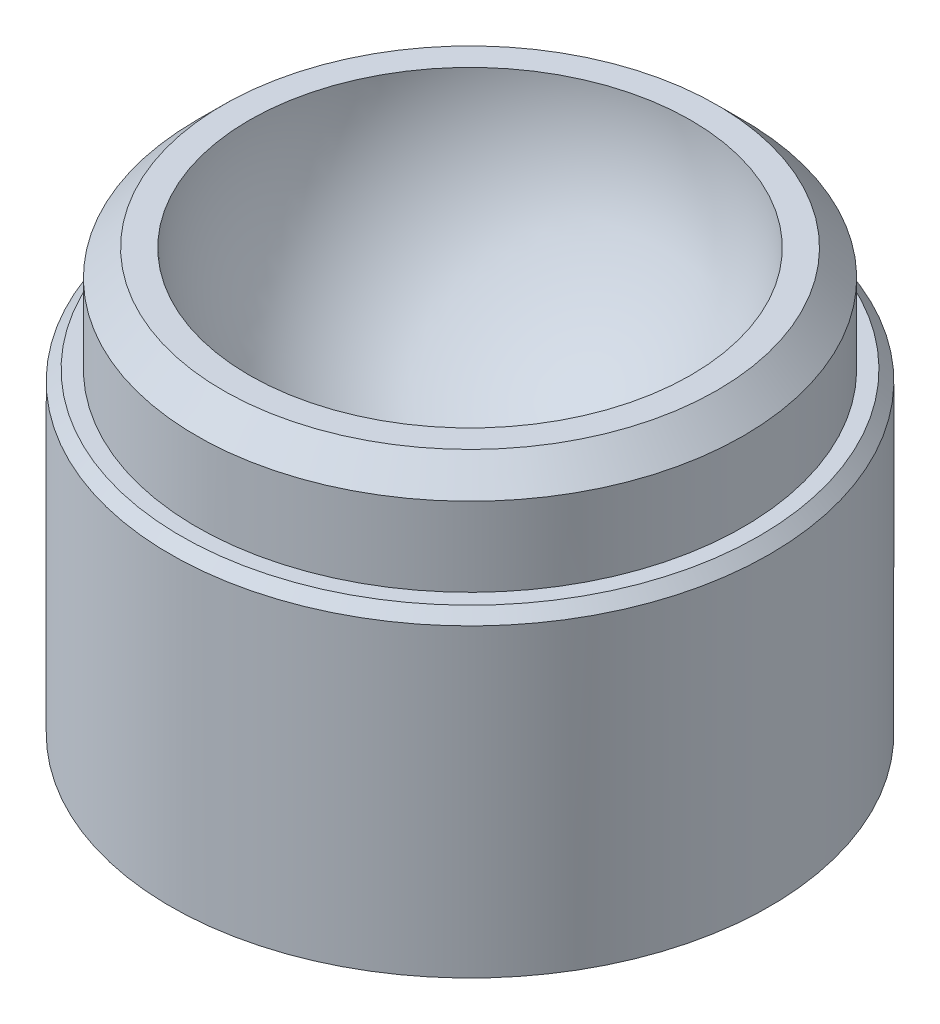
from build123d import *

# Parameters (mm, degrees)
CHANFREIN1_SIZE = 0.5
CHANFREIN2_SIZE = 0.2


with BuildPart() as part:
    # Esquisse1 → R_volution1 (revolve)
    with BuildSketch(Plane.XY, mode=Mode.PRIVATE) as r_volution1_sk:
        with BuildLine():
            Line((0, -6.2), (0, -10))
            Line((0, -10), (5.7, -10))
            Line((5.7, -10), (5.7, -4))
            Line((5.7, -4), (5.2, -4))
            Line((5.2, -4), (5.2, -2))
            Line((5.2, -2), (4.2, -2))
            ThreePointArc((4.2, -2), (2.969848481, -4.969848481), (0, -6.2))
        make_face()
    revolve(r_volution1_sk.sketch.rotate(Axis((0, -6.2, 0), (0, -1, 0)), 180), axis=Axis((0, -6.2, 0), (0, -1, 0)))

    # Chanfrein1
    chanfrein1_edges = [part.edges().sort_by_distance(p)[0] for p in [
        (5.2, -2, 0),
    ]]
    chamfer(chanfrein1_edges, length=CHANFREIN1_SIZE)

    # Chanfrein2
    chanfrein2_edges = [part.edges().sort_by_distance(p)[0] for p in [
        (5.7, -4, 0),
    ]]
    chamfer(chanfrein2_edges, length=CHANFREIN2_SIZE)


solid = part.part
